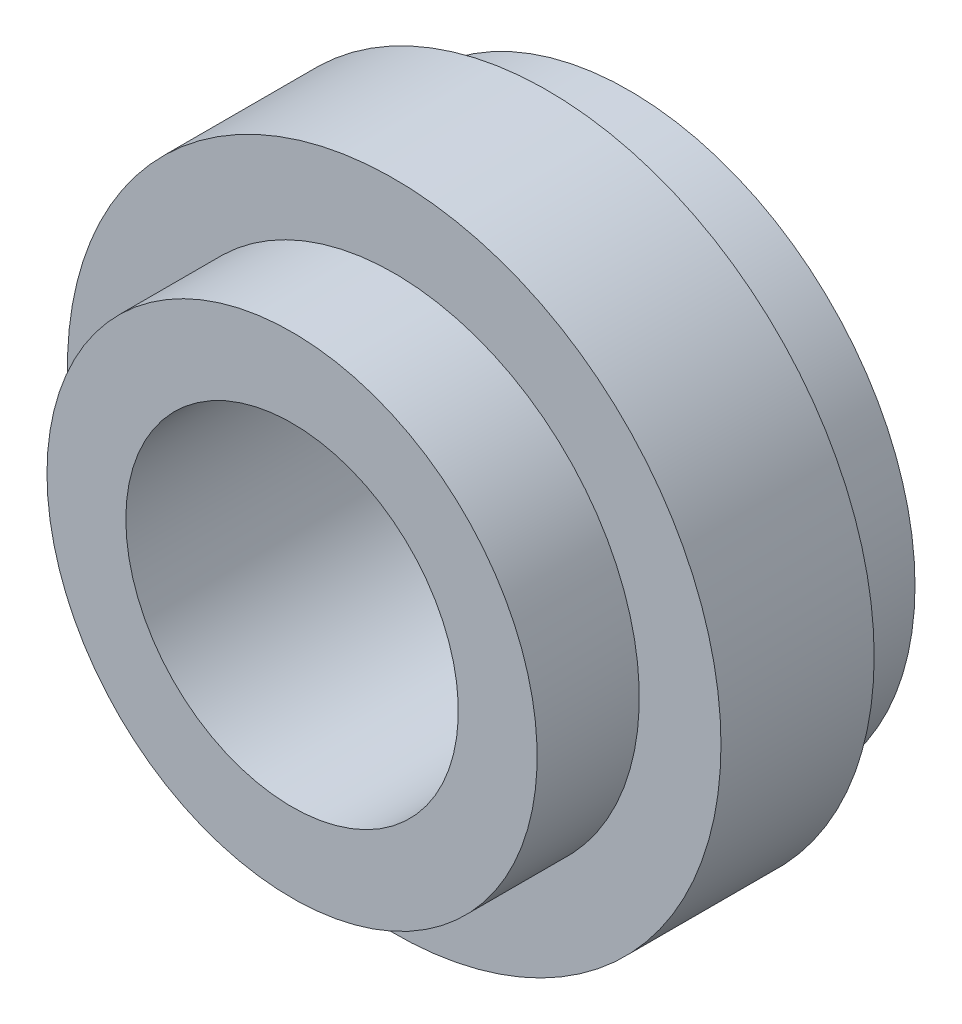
from build123d import *
from build123d.topology import SkipClean

# Parameters (mm, degrees)
SKETCH1_R      = 6
SKETCH1_R_2    = 4.07
EXTRUDE1_DEPTH = 2.5
EXTRUDE2_START = 5.75
SKETCH2_R      = 8
SKETCH2_R_2    = 4.07
EXTRUDE2_DEPTH = 5.75
SKETCH3_W      = 2
SKETCH3_H      = 1


with BuildPart() as part:
    # Sketch1 → Extrude1 (new body)
    with BuildSketch(Plane.XY):
        Circle(SKETCH1_R)
        Circle(SKETCH1_R_2, mode=Mode.SUBTRACT)
    extrude(amount=EXTRUDE1_DEPTH)

    # Sketch2 → Extrude2 (add)
    with SkipClean():  # the faces are left unmerged after this step: merging them gives an invalid solid
        with BuildSketch(Plane(origin=(0, 0, 0), x_dir=(-1, 0, 0), z_dir=(0, 0, -1)).offset(EXTRUDE2_START)):
            Circle(SKETCH2_R)
            Circle(SKETCH2_R_2, mode=Mode.SUBTRACT)
        extrude(amount=-EXTRUDE2_DEPTH)

    # Sketch3 → Cut-Revolve1 (revolve, cut)
    with SkipClean():  # the faces are left unmerged after this step: merging them gives an invalid solid
        with BuildSketch(Plane(origin=(0, 0, 0), x_dir=(0, 0, -1), z_dir=(1, 0, 0)), mode=Mode.PRIVATE) as cut_revolve1_sk:
            with Locations((4.75, 7.5)):
                Rectangle(SKETCH3_W, SKETCH3_H)
        revolve(cut_revolve1_sk.sketch.rotate(Axis((0, 0, 0), (0, 0, -1)), 90), axis=Axis((0, 0, 0), (0, 0, -1)), mode=Mode.SUBTRACT)


solid = part.part
